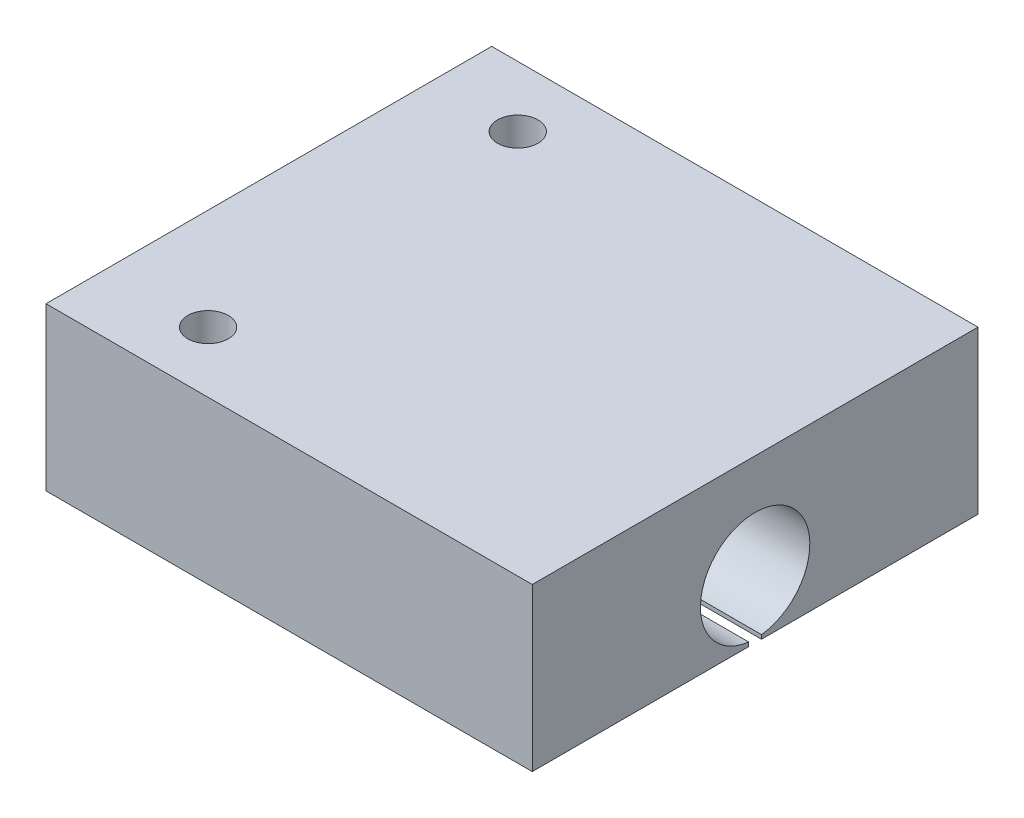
ISO-10303-21;
HEADER;
FILE_DESCRIPTION(('STEP AP214'),'2;1');
FILE_NAME('part.step','',(''),(''),'','','');
FILE_SCHEMA(('AUTOMOTIVE_DESIGN { 1 0 10303 214 1 1 1 1 }'));
ENDSEC;
DATA;
#1=APPLICATION_CONTEXT('core data for automotive mechanical design processes');
#2=APPLICATION_PROTOCOL_DEFINITION('international standard','automotive_design',2000,#1);
#3=PRODUCT_CONTEXT('',#1,'mechanical');
#4=PRODUCT('Part','Part','',(#3));
#5=PRODUCT_RELATED_PRODUCT_CATEGORY('part','',(#4));
#6=PRODUCT_DEFINITION_FORMATION('','',#4);
#7=PRODUCT_DEFINITION_CONTEXT('part definition',#1,'design');
#8=PRODUCT_DEFINITION('design','',#6,#7);
#9=PRODUCT_DEFINITION_SHAPE('','',#8);
#10=(LENGTH_UNIT() NAMED_UNIT(*) SI_UNIT(.MILLI.,.METRE.));
#11=(NAMED_UNIT(*) PLANE_ANGLE_UNIT() SI_UNIT($,.RADIAN.));
#12=(NAMED_UNIT(*) SI_UNIT($,.STERADIAN.) SOLID_ANGLE_UNIT());
#13=UNCERTAINTY_MEASURE_WITH_UNIT(LENGTH_MEASURE(1.E-05),#10,'distance_accuracy_value','');
#14=(GEOMETRIC_REPRESENTATION_CONTEXT(3) GLOBAL_UNCERTAINTY_ASSIGNED_CONTEXT((#13)) GLOBAL_UNIT_ASSIGNED_CONTEXT((#10,
#11,#12)) REPRESENTATION_CONTEXT('',''));
#15=CARTESIAN_POINT('',(0.,0.,0.));
#16=DIRECTION('',(0.,0.,1.));
#17=DIRECTION('',(1.,0.,0.));
#18=AXIS2_PLACEMENT_3D('',#15,#16,#17);
#19=CARTESIAN_POINT('',(0.,0.,0.));
#20=DIRECTION('',(0.,-1.,0.));
#21=DIRECTION('',(0.,0.,-1.));
#22=AXIS2_PLACEMENT_3D('',#19,#20,#21);
#23=PLANE('',#22);
#24=DIRECTION('',(-1.,0.,0.));
#25=VECTOR('',#24,1.);
#26=CARTESIAN_POINT('',(0.,0.,-33.924999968));
#27=LINE('',#26,#25);
#28=CARTESIAN_POINT('',(76.2,0.,-33.924999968));
#29=VERTEX_POINT('',#28);
#30=CARTESIAN_POINT('',(0.,0.,-33.924999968));
#31=VERTEX_POINT('',#30);
#32=EDGE_CURVE('E103',#29,#31,#27,.T.);
#33=ORIENTED_EDGE('',*,*,#32,.F.);
#34=DIRECTION('',(0.,0.,-1.));
#35=VECTOR('',#34,1.);
#36=CARTESIAN_POINT('',(76.2,0.,0.));
#37=LINE('',#36,#35);
#38=CARTESIAN_POINT('',(76.2,0.,0.));
#39=VERTEX_POINT('',#38);
#40=EDGE_CURVE('E127',#39,#29,#37,.T.);
#41=ORIENTED_EDGE('',*,*,#40,.F.);
#42=DIRECTION('',(1.,0.,0.));
#43=VECTOR('',#42,1.);
#44=CARTESIAN_POINT('',(0.,0.,0.));
#45=LINE('',#44,#43);
#46=CARTESIAN_POINT('',(0.,0.,0.));
#47=VERTEX_POINT('',#46);
#48=EDGE_CURVE('E118',#47,#39,#45,.T.);
#49=ORIENTED_EDGE('',*,*,#48,.F.);
#50=DIRECTION('',(0.,0.,1.));
#51=VECTOR('',#50,1.);
#52=CARTESIAN_POINT('',(0.,0.,0.));
#53=LINE('',#52,#51);
#54=EDGE_CURVE('E119',#31,#47,#53,.T.);
#55=ORIENTED_EDGE('',*,*,#54,.F.);
#56=EDGE_LOOP('',(#33,#41,#49,#55));
#57=FACE_BOUND('',#56,.T.);
#58=CARTESIAN_POINT('',(15.875,0.,-9.525));
#59=DIRECTION('',(0.,1.,0.));
#60=DIRECTION('',(0.,0.,1.));
#61=AXIS2_PLACEMENT_3D('',#58,#59,#60);
#62=CIRCLE('',#61,3.175);
#63=CARTESIAN_POINT('',(15.875,0.,-6.35));
#64=VERTEX_POINT('',#63);
#65=EDGE_CURVE('E161',#64,#64,#62,.T.);
#66=ORIENTED_EDGE('',*,*,#65,.T.);
#67=EDGE_LOOP('',(#66));
#68=FACE_BOUND('',#67,.T.);
#69=ADVANCED_FACE('F33',(#57,#68),#23,.T.);
#70=CARTESIAN_POINT('',(0.,25.4,0.));
#71=DIRECTION('',(0.,-1.,0.));
#72=DIRECTION('',(0.,0.,-1.));
#73=AXIS2_PLACEMENT_3D('',#70,#71,#72);
#74=PLANE('',#73);
#75=CARTESIAN_POINT('',(15.875,25.4,-9.525));
#76=DIRECTION('',(0.,1.,0.));
#77=DIRECTION('',(0.,0.,1.));
#78=AXIS2_PLACEMENT_3D('',#75,#76,#77);
#79=CIRCLE('',#78,3.175);
#80=CARTESIAN_POINT('',(15.875,25.4,-6.35));
#81=VERTEX_POINT('',#80);
#82=EDGE_CURVE('E122',#81,#81,#79,.T.);
#83=ORIENTED_EDGE('',*,*,#82,.F.);
#84=EDGE_LOOP('',(#83));
#85=FACE_BOUND('',#84,.T.);
#86=DIRECTION('',(0.,0.,1.));
#87=VECTOR('',#86,1.);
#88=CARTESIAN_POINT('',(0.,25.4,0.));
#89=LINE('',#88,#87);
#90=CARTESIAN_POINT('',(0.,25.4,-69.85));
#91=VERTEX_POINT('',#90);
#92=CARTESIAN_POINT('',(0.,25.4,0.));
#93=VERTEX_POINT('',#92);
#94=EDGE_CURVE('E132',#91,#93,#89,.T.);
#95=ORIENTED_EDGE('',*,*,#94,.T.);
#96=DIRECTION('',(1.,0.,0.));
#97=VECTOR('',#96,1.);
#98=CARTESIAN_POINT('',(0.,25.4,0.));
#99=LINE('',#98,#97);
#100=CARTESIAN_POINT('',(76.2,25.4,0.));
#101=VERTEX_POINT('',#100);
#102=EDGE_CURVE('E169',#93,#101,#99,.T.);
#103=ORIENTED_EDGE('',*,*,#102,.T.);
#104=DIRECTION('',(0.,0.,-1.));
#105=VECTOR('',#104,1.);
#106=CARTESIAN_POINT('',(76.2,25.4,0.));
#107=LINE('',#106,#105);
#108=CARTESIAN_POINT('',(76.2,25.4,-69.85));
#109=VERTEX_POINT('',#108);
#110=EDGE_CURVE('E170',#101,#109,#107,.T.);
#111=ORIENTED_EDGE('',*,*,#110,.T.);
#112=DIRECTION('',(-1.,0.,0.));
#113=VECTOR('',#112,1.);
#114=CARTESIAN_POINT('',(0.,25.4,-69.85));
#115=LINE('',#114,#113);
#116=EDGE_CURVE('E124',#109,#91,#115,.T.);
#117=ORIENTED_EDGE('',*,*,#116,.T.);
#118=EDGE_LOOP('',(#95,#103,#111,#117));
#119=FACE_BOUND('',#118,.T.);
#120=CARTESIAN_POINT('',(13.5990213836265,25.4,-60.325));
#121=DIRECTION('',(0.,1.,0.));
#122=DIRECTION('',(0.,0.,1.));
#123=AXIS2_PLACEMENT_3D('',#120,#121,#122);
#124=CIRCLE('',#123,3.175);
#125=CARTESIAN_POINT('',(13.5990213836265,25.4,-57.15));
#126=VERTEX_POINT('',#125);
#127=EDGE_CURVE('E155',#126,#126,#124,.T.);
#128=ORIENTED_EDGE('',*,*,#127,.F.);
#129=EDGE_LOOP('',(#128));
#130=FACE_BOUND('',#129,.T.);
#131=ADVANCED_FACE('F175',(#85,#119,#130),#74,.F.);
#132=DIRECTION('',(1.,0.,0.));
#133=VECTOR('',#132,1.);
#134=CARTESIAN_POINT('',(0.,0.,-35.925000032));
#135=LINE('',#134,#133);
#136=CARTESIAN_POINT('',(0.,0.,-35.925000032));
#137=VERTEX_POINT('',#136);
#138=CARTESIAN_POINT('',(76.2,0.,-35.925000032));
#139=VERTEX_POINT('',#138);
#140=EDGE_CURVE('E98',#137,#139,#135,.T.);
#141=ORIENTED_EDGE('',*,*,#140,.F.);
#142=CARTESIAN_POINT('',(0.,0.,-69.85));
#143=VERTEX_POINT('',#142);
#144=EDGE_CURVE('E111',#143,#137,#53,.T.);
#145=ORIENTED_EDGE('',*,*,#144,.F.);
#146=DIRECTION('',(-1.,0.,0.));
#147=VECTOR('',#146,1.);
#148=CARTESIAN_POINT('',(0.,0.,-69.85));
#149=LINE('',#148,#147);
#150=CARTESIAN_POINT('',(76.2,0.,-69.85));
#151=VERTEX_POINT('',#150);
#152=EDGE_CURVE('E130',#151,#143,#149,.T.);
#153=ORIENTED_EDGE('',*,*,#152,.F.);
#154=EDGE_CURVE('E112',#139,#151,#37,.T.);
#155=ORIENTED_EDGE('',*,*,#154,.F.);
#156=EDGE_LOOP('',(#141,#145,#153,#155));
#157=FACE_BOUND('',#156,.T.);
#158=CARTESIAN_POINT('',(13.5990213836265,0.,-60.325));
#159=DIRECTION('',(0.,1.,0.));
#160=DIRECTION('',(0.,0.,1.));
#161=AXIS2_PLACEMENT_3D('',#158,#159,#160);
#162=CIRCLE('',#161,3.175);
#163=CARTESIAN_POINT('',(13.5990213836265,0.,-57.15));
#164=VERTEX_POINT('',#163);
#165=EDGE_CURVE('E152',#164,#164,#162,.T.);
#166=ORIENTED_EDGE('',*,*,#165,.T.);
#167=EDGE_LOOP('',(#166));
#168=FACE_BOUND('',#167,.T.);
#169=ADVANCED_FACE('F108',(#157,#168),#23,.T.);
#170=CARTESIAN_POINT('',(0.,25.4,0.));
#171=DIRECTION('',(1.,0.,0.));
#172=DIRECTION('',(0.,0.,-1.));
#173=AXIS2_PLACEMENT_3D('',#170,#171,#172);
#174=PLANE('',#173);
#175=CARTESIAN_POINT('',(0.,9.144,-34.925));
#176=DIRECTION('',(-1.,0.,0.));
#177=DIRECTION('',(0.,0.,1.));
#178=AXIS2_PLACEMENT_3D('',#175,#176,#177);
#179=CIRCLE('',#178,8.5725);
#180=CARTESIAN_POINT('',(0.,0.630025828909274,-33.924999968));
#181=VERTEX_POINT('',#180);
#182=CARTESIAN_POINT('',(0.,0.630025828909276,-35.925000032));
#183=VERTEX_POINT('',#182);
#184=EDGE_CURVE('E147',#181,#183,#179,.T.);
#185=ORIENTED_EDGE('',*,*,#184,.F.);
#186=DIRECTION('',(0.,-1.,0.));
#187=VECTOR('',#186,1.);
#188=CARTESIAN_POINT('',(0.,2.54,-33.924999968));
#189=LINE('',#188,#187);
#190=EDGE_CURVE('E48',#181,#31,#189,.T.);
#191=ORIENTED_EDGE('',*,*,#190,.T.);
#192=ORIENTED_EDGE('',*,*,#54,.T.);
#193=DIRECTION('',(0.,-1.,0.));
#194=VECTOR('',#193,1.);
#195=CARTESIAN_POINT('',(0.,25.4,0.));
#196=LINE('',#195,#194);
#197=EDGE_CURVE('E140',#93,#47,#196,.T.);
#198=ORIENTED_EDGE('',*,*,#197,.F.);
#199=ORIENTED_EDGE('',*,*,#94,.F.);
#200=DIRECTION('',(0.,-1.,0.));
#201=VECTOR('',#200,1.);
#202=CARTESIAN_POINT('',(0.,25.4,-69.85));
#203=LINE('',#202,#201);
#204=EDGE_CURVE('E117',#91,#143,#203,.T.);
#205=ORIENTED_EDGE('',*,*,#204,.T.);
#206=ORIENTED_EDGE('',*,*,#144,.T.);
#207=DIRECTION('',(0.,-1.,0.));
#208=VECTOR('',#207,1.);
#209=CARTESIAN_POINT('',(0.,2.54,-35.925000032));
#210=LINE('',#209,#208);
#211=EDGE_CURVE('E95',#183,#137,#210,.T.);
#212=ORIENTED_EDGE('',*,*,#211,.F.);
#213=EDGE_LOOP('',(#185,#191,#192,#198,#199,#205,#206,#212));
#214=FACE_BOUND('',#213,.T.);
#215=ADVANCED_FACE('F35',(#214),#174,.F.);
#216=CARTESIAN_POINT('',(0.,25.4,0.));
#217=DIRECTION('',(0.,0.,-1.));
#218=DIRECTION('',(-1.,0.,0.));
#219=AXIS2_PLACEMENT_3D('',#216,#217,#218);
#220=PLANE('',#219);
#221=ORIENTED_EDGE('',*,*,#48,.T.);
#222=DIRECTION('',(0.,-1.,0.));
#223=VECTOR('',#222,1.);
#224=CARTESIAN_POINT('',(76.2,25.4,0.));
#225=LINE('',#224,#223);
#226=EDGE_CURVE('E137',#101,#39,#225,.T.);
#227=ORIENTED_EDGE('',*,*,#226,.F.);
#228=ORIENTED_EDGE('',*,*,#102,.F.);
#229=ORIENTED_EDGE('',*,*,#197,.T.);
#230=EDGE_LOOP('',(#221,#227,#228,#229));
#231=FACE_BOUND('',#230,.T.);
#232=ADVANCED_FACE('F183',(#231),#220,.F.);
#233=CARTESIAN_POINT('',(76.2,25.4,0.));
#234=DIRECTION('',(-1.,0.,0.));
#235=DIRECTION('',(0.,0.,1.));
#236=AXIS2_PLACEMENT_3D('',#233,#234,#235);
#237=PLANE('',#236);
#238=ORIENTED_EDGE('',*,*,#40,.T.);
#239=DIRECTION('',(0.,-1.,0.));
#240=VECTOR('',#239,1.);
#241=CARTESIAN_POINT('',(76.2,2.54,-33.924999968));
#242=LINE('',#241,#240);
#243=CARTESIAN_POINT('',(76.2,0.630025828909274,-33.924999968));
#244=VERTEX_POINT('',#243);
#245=EDGE_CURVE('E151',#244,#29,#242,.T.);
#246=ORIENTED_EDGE('',*,*,#245,.F.);
#247=CARTESIAN_POINT('',(76.2,9.144,-34.925));
#248=DIRECTION('',(-1.,0.,0.));
#249=DIRECTION('',(0.,0.,1.));
#250=AXIS2_PLACEMENT_3D('',#247,#248,#249);
#251=CIRCLE('',#250,8.5725);
#252=CARTESIAN_POINT('',(76.2,0.630025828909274,-35.925000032));
#253=VERTEX_POINT('',#252);
#254=EDGE_CURVE('E146',#244,#253,#251,.T.);
#255=ORIENTED_EDGE('',*,*,#254,.T.);
#256=DIRECTION('',(0.,-1.,0.));
#257=VECTOR('',#256,1.);
#258=CARTESIAN_POINT('',(76.2,2.54,-35.925000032));
#259=LINE('',#258,#257);
#260=EDGE_CURVE('E55',#253,#139,#259,.T.);
#261=ORIENTED_EDGE('',*,*,#260,.T.);
#262=ORIENTED_EDGE('',*,*,#154,.T.);
#263=DIRECTION('',(0.,-1.,0.));
#264=VECTOR('',#263,1.);
#265=CARTESIAN_POINT('',(76.2,25.4,-69.85));
#266=LINE('',#265,#264);
#267=EDGE_CURVE('E134',#109,#151,#266,.T.);
#268=ORIENTED_EDGE('',*,*,#267,.F.);
#269=ORIENTED_EDGE('',*,*,#110,.F.);
#270=ORIENTED_EDGE('',*,*,#226,.T.);
#271=EDGE_LOOP('',(#238,#246,#255,#261,#262,#268,#269,#270));
#272=FACE_BOUND('',#271,.T.);
#273=ADVANCED_FACE('F150',(#272),#237,.F.);
#274=CARTESIAN_POINT('',(0.,25.4,-69.85));
#275=DIRECTION('',(0.,0.,1.));
#276=DIRECTION('',(1.,0.,0.));
#277=AXIS2_PLACEMENT_3D('',#274,#275,#276);
#278=PLANE('',#277);
#279=ORIENTED_EDGE('',*,*,#152,.T.);
#280=ORIENTED_EDGE('',*,*,#204,.F.);
#281=ORIENTED_EDGE('',*,*,#116,.F.);
#282=ORIENTED_EDGE('',*,*,#267,.T.);
#283=EDGE_LOOP('',(#279,#280,#281,#282));
#284=FACE_BOUND('',#283,.T.);
#285=ADVANCED_FACE('F179',(#284),#278,.F.);
#286=CARTESIAN_POINT('',(15.875,25.4,-9.525));
#287=DIRECTION('',(0.,-1.,0.));
#288=DIRECTION('',(0.,0.,-1.));
#289=AXIS2_PLACEMENT_3D('',#286,#287,#288);
#290=CYLINDRICAL_SURFACE('',#289,3.175);
#291=ORIENTED_EDGE('',*,*,#82,.T.);
#292=EDGE_LOOP('',(#291));
#293=FACE_BOUND('',#292,.T.);
#294=ORIENTED_EDGE('',*,*,#65,.F.);
#295=EDGE_LOOP('',(#294));
#296=FACE_BOUND('',#295,.T.);
#297=ADVANCED_FACE('F219',(#293,#296),#290,.F.);
#298=CARTESIAN_POINT('',(13.5990213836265,25.4,-60.325));
#299=DIRECTION('',(0.,-1.,0.));
#300=DIRECTION('',(0.,0.,-1.));
#301=AXIS2_PLACEMENT_3D('',#298,#299,#300);
#302=CYLINDRICAL_SURFACE('',#301,3.175);
#303=ORIENTED_EDGE('',*,*,#127,.T.);
#304=EDGE_LOOP('',(#303));
#305=FACE_BOUND('',#304,.T.);
#306=ORIENTED_EDGE('',*,*,#165,.F.);
#307=EDGE_LOOP('',(#306));
#308=FACE_BOUND('',#307,.T.);
#309=ADVANCED_FACE('F223',(#305,#308),#302,.F.);
#310=CARTESIAN_POINT('',(76.2,9.144,-34.925));
#311=DIRECTION('',(-1.,0.,0.));
#312=DIRECTION('',(0.,0.,1.));
#313=AXIS2_PLACEMENT_3D('',#310,#311,#312);
#314=CYLINDRICAL_SURFACE('',#313,8.5725);
#315=ORIENTED_EDGE('',*,*,#254,.F.);
#316=DIRECTION('',(-1.,0.,0.));
#317=VECTOR('',#316,1.);
#318=CARTESIAN_POINT('',(76.2,0.630025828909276,-33.924999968));
#319=LINE('',#318,#317);
#320=EDGE_CURVE('E11',#244,#181,#319,.T.);
#321=ORIENTED_EDGE('',*,*,#320,.T.);
#322=ORIENTED_EDGE('',*,*,#184,.T.);
#323=DIRECTION('',(-1.,0.,0.));
#324=VECTOR('',#323,1.);
#325=CARTESIAN_POINT('',(76.2,0.630025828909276,-35.925000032));
#326=LINE('',#325,#324);
#327=EDGE_CURVE('E41',#183,#253,#326,.F.);
#328=ORIENTED_EDGE('',*,*,#327,.T.);
#329=EDGE_LOOP('',(#315,#321,#322,#328));
#330=FACE_BOUND('',#329,.T.);
#331=ADVANCED_FACE('F145',(#330),#314,.F.);
#332=CARTESIAN_POINT('',(0.,2.54,-35.925000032));
#333=DIRECTION('',(0.,0.,-1.));
#334=DIRECTION('',(-1.,0.,0.));
#335=AXIS2_PLACEMENT_3D('',#332,#333,#334);
#336=PLANE('',#335);
#337=ORIENTED_EDGE('',*,*,#211,.T.);
#338=ORIENTED_EDGE('',*,*,#140,.T.);
#339=ORIENTED_EDGE('',*,*,#260,.F.);
#340=ORIENTED_EDGE('',*,*,#327,.F.);
#341=EDGE_LOOP('',(#337,#338,#339,#340));
#342=FACE_BOUND('',#341,.T.);
#343=ADVANCED_FACE('F97',(#342),#336,.F.);
#344=CARTESIAN_POINT('',(0.,2.54,-33.924999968));
#345=DIRECTION('',(0.,0.,1.));
#346=DIRECTION('',(1.,0.,0.));
#347=AXIS2_PLACEMENT_3D('',#344,#345,#346);
#348=PLANE('',#347);
#349=ORIENTED_EDGE('',*,*,#245,.T.);
#350=ORIENTED_EDGE('',*,*,#32,.T.);
#351=ORIENTED_EDGE('',*,*,#190,.F.);
#352=ORIENTED_EDGE('',*,*,#320,.F.);
#353=EDGE_LOOP('',(#349,#350,#351,#352));
#354=FACE_BOUND('',#353,.T.);
#355=ADVANCED_FACE('F192',(#354),#348,.F.);
#356=CLOSED_SHELL('',(#69,#131,#169,#215,#232,#273,#285,#297,#309,#331,#343,#355));
#357=MANIFOLD_SOLID_BREP('B2',#356);
#358=ADVANCED_BREP_SHAPE_REPRESENTATION('',(#18,#357),#14);
#359=SHAPE_DEFINITION_REPRESENTATION(#9,#358);
ENDSEC;
END-ISO-10303-21;
